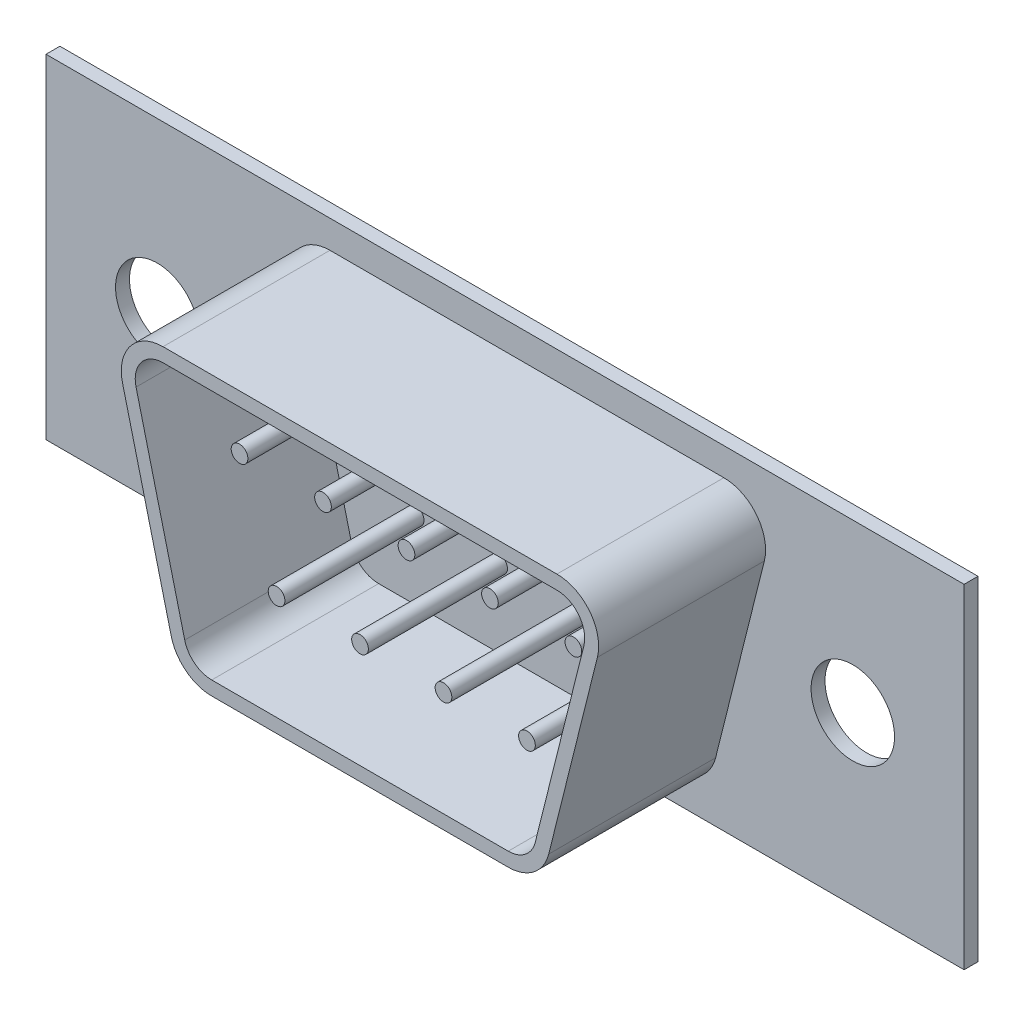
from build123d import *

# Parameters (mm, degrees)
ESQUISSE1_W      = 33
ESQUISSE1_H      = 12
ESQUISSE1_R      = 1.5
EXTRUSION1_DEPTH = 0.5
EXTRUSION2_DEPTH = 6
CONG_2_R         = 1
CONG_3_R         = 1
CONG_4_R         = 1.5
ESQUISSE3_R      = 0.3
EXTRUSION3_DEPTH = 5


with BuildPart() as part:
    # Esquisse1 → Extrusion1 (new body)
    with BuildSketch(Plane.XY):
        Rectangle(ESQUISSE1_W, ESQUISSE1_H)
        with Locations((-12.5, 0)):
            Circle(ESQUISSE1_R, mode=Mode.SUBTRACT)
        with Locations((12.5, 0)):
            Circle(ESQUISSE1_R, mode=Mode.SUBTRACT)
    extrude(amount=EXTRUSION1_DEPTH)

    # Esquisse2 → Extrusion2 (add)
    with BuildSketch(Plane.XY.offset(0.5)):
        Polygon((-8.214359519, 5), (9.785640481, 5), (7.285640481, -5), (-5.714359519, -5), align=None)
        Polygon((-5.323971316, -4.5), (-7.573971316, 4.5), (9.145252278, 4.5), (6.895252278, -4.5), align=None, mode=Mode.SUBTRACT)
    extrude(amount=EXTRUSION2_DEPTH)

    # Cong_2
    cong_2_edges = [part.edges().sort_by_distance(p)[0] for p in [
        (-7.573971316, 4.5, 3.5),
        (-5.323971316, -4.5, 3.5),
    ]]
    fillet(cong_2_edges, radius=CONG_2_R)

    # Cong_3
    cong_3_edges = [part.edges().sort_by_distance(p)[0] for p in [
        (6.895252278, -4.5, 3.5),
        (9.145252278, 4.5, 3.5),
    ]]
    fillet(cong_3_edges, radius=CONG_3_R)

    # Cong_4
    cong_4_edges = [part.edges().sort_by_distance(p)[0] for p in [
        (-8.214359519, 5, 3.5),
        (-5.714359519, -5, 3.5),
        (7.285640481, -5, 3.5),
        (9.785640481, 5, 3.5),
    ]]
    fillet(cong_4_edges, radius=CONG_4_R)

    # Esquisse3 → Extrusion3 (add)
    with BuildSketch(Plane.XY.offset(0.5)):
        with Locations(Location((-4.543137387, 2.042117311, 0), (0, 0, 180))):
            Circle(ESQUISSE3_R)
        with Locations(Location((-1.543137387, 2.042117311, 0), (0, 0, 180))):
            Circle(ESQUISSE3_R)
        with Locations(Location((1.456862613, 2.042117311, 0), (0, 0, 180))):
            Circle(ESQUISSE3_R)
        with Locations(Location((4.456862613, 2.042117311, 0), (0, 0, 180))):
            Circle(ESQUISSE3_R)
        with Locations(Location((7.456862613, 2.042117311, 0), (0, 0, 180))):
            Circle(ESQUISSE3_R)
        with Locations(Location((-3.212319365, -1.720885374, 0), (0, 0, 180))):
            Circle(ESQUISSE3_R)
        with Locations(Location((-0.212319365, -1.720885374, 0), (0, 0, 180))):
            Circle(ESQUISSE3_R)
        with Locations(Location((2.787680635, -1.720885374, 0), (0, 0, 180))):
            Circle(ESQUISSE3_R)
        with Locations(Location((5.787680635, -1.720885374, 0), (0, 0, 180))):
            Circle(ESQUISSE3_R)
    extrude(amount=EXTRUSION3_DEPTH)


solid = part.part
